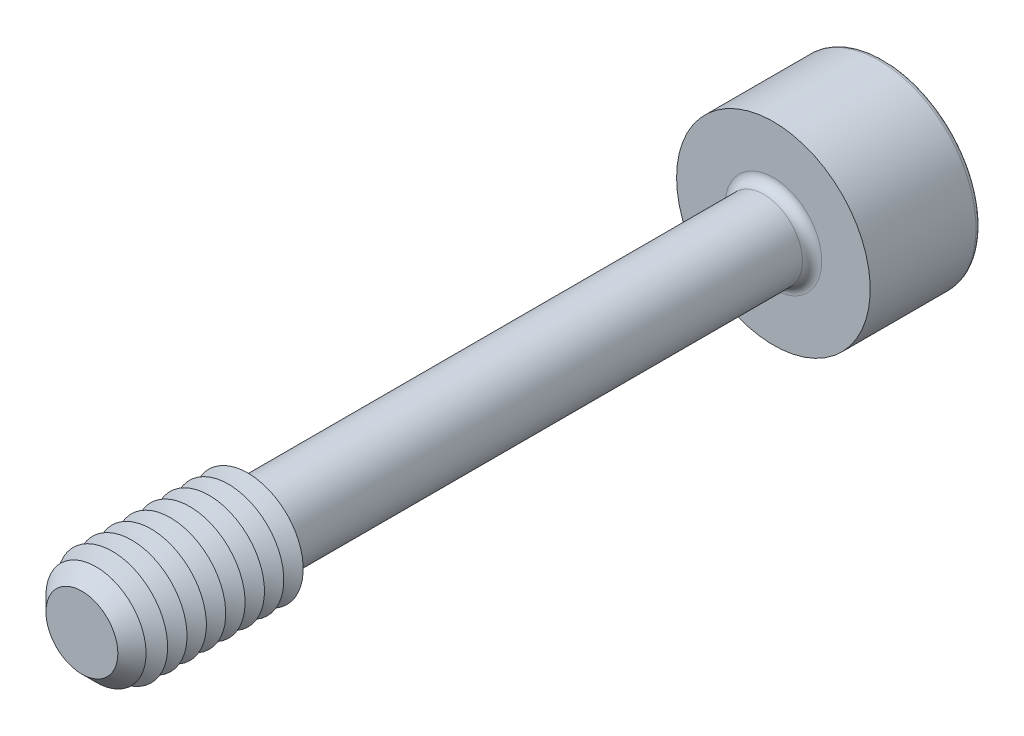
from build123d import *

# Parameters (mm, degrees)
SKETCH1_R       = 1.4
EXTRUDE1_DEPTH  = 12.5
CHAMFER1_SIZE   = 0.7
SKETCH3_R       = 3.5
EXTRUDE2_DEPTH  = 4
EXTRUDE3_DEPTH  = 3
FILLET1_R       = 0.35
FILLET2_R       = 0.175
LPATTERN1_COUNT = 8
LPATTERN1_PITCH = 0.7


with BuildPart() as part:
    # Sketch1 → Extrude1 (new, symmetric)
    with BuildSketch(Plane.XY):
        Circle(SKETCH1_R)
    extrude(amount=EXTRUDE1_DEPTH, both=True)

    # Sketch2 → Revolve1 (revolve)
    with BuildSketch(Plane(origin=(0, 0, 0), x_dir=(0, 0, -1), z_dir=(1, 0, 0))):
        Polygon((-12.5, 0), (-12.5, 2), (-6.5, 2), (-6.153589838, 1.4), (-6.153589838, 0), align=None)
    revolve(axis=Axis((0, 0, 6.153589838), (0, 0, 1)))

    # Chamfer1
    chamfer1_edges = [part.edges().sort_by_distance(p)[0] for p in [
        (0, -2, 12.5),
    ]]
    chamfer(chamfer1_edges, length=CHAMFER1_SIZE)

    # Sketch3 → Extrude2 (add)
    with BuildSketch(Plane(origin=(0, 0, -12.5), x_dir=(-1, 0, 0), z_dir=(0, 0, -1))):
        Circle(SKETCH3_R)
    extrude(amount=EXTRUDE2_DEPTH)

    # Sketch4 → Extrude3 (cut)
    with BuildSketch(Plane(origin=(-13.7, 0, -16.5), x_dir=(1, 0, 0), z_dir=(0, 0, 1))):
        Polygon((12.833974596, -1.5), (14.566025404, -1.5), (15.432050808, 0), (14.566025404, 1.5), (12.833974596, 1.5), (11.967949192, 0), align=None)
    extrude(amount=EXTRUDE3_DEPTH, mode=Mode.SUBTRACT)

    # Fillet1
    fillet1_edges = [part.edges().sort_by_distance(p)[0] for p in [
        (-1.4, 0, -12.5),
    ]]
    fillet(fillet1_edges, radius=FILLET1_R)

    # Fillet2
    fillet2_edges = [part.edges().sort_by_distance(p)[0] for p in [
        (3.5, 0, -16.5),
    ]]
    fillet(fillet2_edges, radius=FILLET2_R)

    # Sketch5 → Cut-Revolve1 (revolve, cut)
    with BuildSketch(Plane(origin=(0, 0, 0), x_dir=(0, 0, -1), z_dir=(1, 0, 0)), mode=Mode.PRIVATE) as cut_revolve1_sk:
        Polygon((13.5, 0), (13.5, -1.5), (12.633974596, 0), align=None)
    revolve(cut_revolve1_sk.sketch.rotate(Axis((0, 0, -12.633974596), (0, 0, -1)), 90), axis=Axis((0, 0, -12.633974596), (0, 0, -1)), mode=Mode.SUBTRACT)

    # Sketch7 → Cut-Revolve2 (revolve, cut)
    with BuildSketch(Plane(origin=(0, 0, 0), x_dir=(0, 0, -1), z_dir=(1, 0, 0)), mode=Mode.PRIVATE) as cut_revolve2_sk:
        Polygon((-6.5, 2), (-6.85, 1.393782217), (-7.2, 2), align=None)
    cut_revolve2 = revolve(cut_revolve2_sk.sketch.rotate(Axis((0, 0, -1.332048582), (0, 0, 1)), 90), axis=Axis((0, 0, -1.332048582), (0, 0, 1)), mode=Mode.SUBTRACT)

    # LPattern1: Cut-Revolve2 ×8
    with Locations(*[(0, 0, i * LPATTERN1_PITCH) for i in range(1, LPATTERN1_COUNT)]):
        add(cut_revolve2, mode=Mode.SUBTRACT)


solid = part.part
